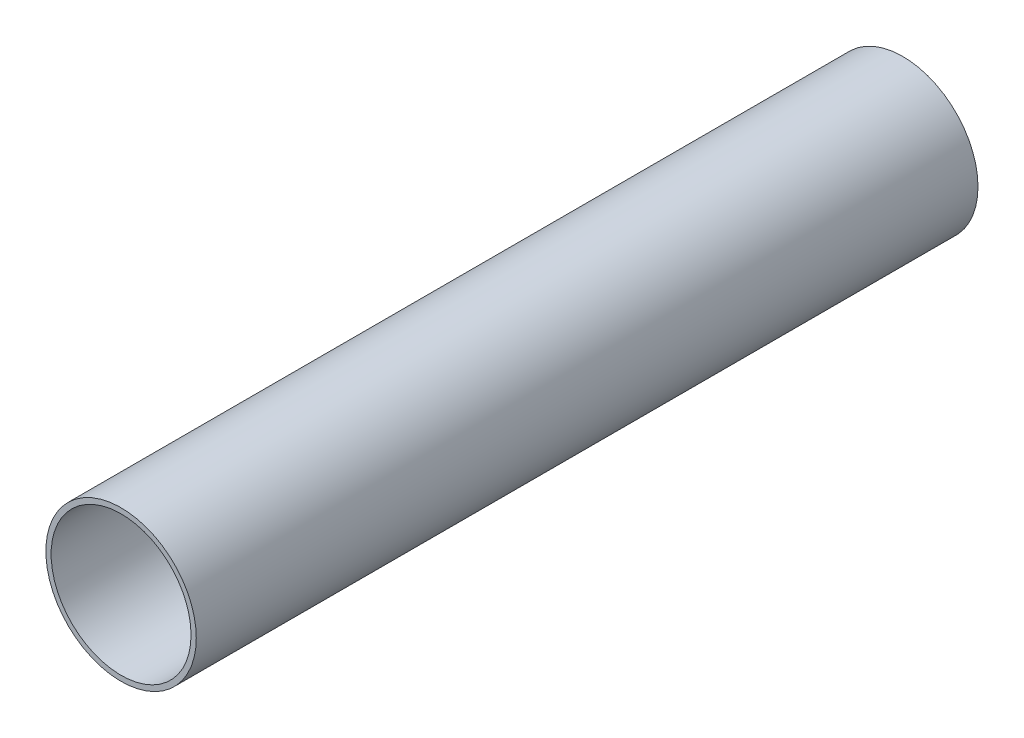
ISO-10303-21;
HEADER;
FILE_DESCRIPTION(('STEP AP214'),'2;1');
FILE_NAME('part.step','',(''),(''),'','','');
FILE_SCHEMA(('AUTOMOTIVE_DESIGN { 1 0 10303 214 1 1 1 1 }'));
ENDSEC;
DATA;
#1=APPLICATION_CONTEXT('core data for automotive mechanical design processes');
#2=APPLICATION_PROTOCOL_DEFINITION('international standard','automotive_design',2000,#1);
#3=PRODUCT_CONTEXT('',#1,'mechanical');
#4=PRODUCT('Part','Part','',(#3));
#5=PRODUCT_RELATED_PRODUCT_CATEGORY('part','',(#4));
#6=PRODUCT_DEFINITION_FORMATION('','',#4);
#7=PRODUCT_DEFINITION_CONTEXT('part definition',#1,'design');
#8=PRODUCT_DEFINITION('design','',#6,#7);
#9=PRODUCT_DEFINITION_SHAPE('','',#8);
#10=(LENGTH_UNIT() NAMED_UNIT(*) SI_UNIT(.MILLI.,.METRE.));
#11=(NAMED_UNIT(*) PLANE_ANGLE_UNIT() SI_UNIT($,.RADIAN.));
#12=(NAMED_UNIT(*) SI_UNIT($,.STERADIAN.) SOLID_ANGLE_UNIT());
#13=UNCERTAINTY_MEASURE_WITH_UNIT(LENGTH_MEASURE(1.E-05),#10,'distance_accuracy_value','');
#14=(GEOMETRIC_REPRESENTATION_CONTEXT(3) GLOBAL_UNCERTAINTY_ASSIGNED_CONTEXT((#13)) GLOBAL_UNIT_ASSIGNED_CONTEXT((#10,
#11,#12)) REPRESENTATION_CONTEXT('',''));
#15=CARTESIAN_POINT('',(0.,0.,0.));
#16=DIRECTION('',(0.,0.,1.));
#17=DIRECTION('',(1.,0.,0.));
#18=AXIS2_PLACEMENT_3D('',#15,#16,#17);
#19=CARTESIAN_POINT('',(0.,0.,302.26));
#20=DIRECTION('',(0.,0.,1.));
#21=DIRECTION('',(1.,0.,0.));
#22=AXIS2_PLACEMENT_3D('',#19,#20,#21);
#23=PLANE('',#22);
#24=CARTESIAN_POINT('',(0.,0.,302.26));
#25=DIRECTION('',(0.,0.,1.));
#26=DIRECTION('',(1.,0.,0.));
#27=AXIS2_PLACEMENT_3D('',#24,#25,#26);
#28=CIRCLE('',#27,29.083);
#29=CARTESIAN_POINT('',(29.083,0.,302.26));
#30=VERTEX_POINT('',#29);
#31=EDGE_CURVE('E10',#30,#30,#28,.T.);
#32=ORIENTED_EDGE('',*,*,#31,.T.);
#33=EDGE_LOOP('',(#32));
#34=FACE_BOUND('',#33,.T.);
#35=CARTESIAN_POINT('',(0.,0.,302.26));
#36=DIRECTION('',(0.,0.,1.));
#37=DIRECTION('',(1.,0.,0.));
#38=AXIS2_PLACEMENT_3D('',#35,#36,#37);
#39=CIRCLE('',#38,27.051);
#40=CARTESIAN_POINT('',(27.051,0.,302.26));
#41=VERTEX_POINT('',#40);
#42=EDGE_CURVE('E39',#41,#41,#39,.T.);
#43=ORIENTED_EDGE('',*,*,#42,.F.);
#44=EDGE_LOOP('',(#43));
#45=FACE_BOUND('',#44,.T.);
#46=ADVANCED_FACE('F28',(#34,#45),#23,.T.);
#47=CARTESIAN_POINT('',(0.,0.,0.));
#48=DIRECTION('',(0.,0.,1.));
#49=DIRECTION('',(1.,0.,0.));
#50=AXIS2_PLACEMENT_3D('',#47,#48,#49);
#51=PLANE('',#50);
#52=CARTESIAN_POINT('',(0.,0.,0.));
#53=DIRECTION('',(0.,0.,1.));
#54=DIRECTION('',(1.,0.,0.));
#55=AXIS2_PLACEMENT_3D('',#52,#53,#54);
#56=CIRCLE('',#55,29.083);
#57=CARTESIAN_POINT('',(29.083,0.,0.));
#58=VERTEX_POINT('',#57);
#59=EDGE_CURVE('E35',#58,#58,#56,.T.);
#60=ORIENTED_EDGE('',*,*,#59,.F.);
#61=EDGE_LOOP('',(#60));
#62=FACE_BOUND('',#61,.T.);
#63=CARTESIAN_POINT('',(0.,0.,0.));
#64=DIRECTION('',(0.,0.,1.));
#65=DIRECTION('',(1.,0.,0.));
#66=AXIS2_PLACEMENT_3D('',#63,#64,#65);
#67=CIRCLE('',#66,27.051);
#68=CARTESIAN_POINT('',(27.051,0.,0.));
#69=VERTEX_POINT('',#68);
#70=EDGE_CURVE('E43',#69,#69,#67,.T.);
#71=ORIENTED_EDGE('',*,*,#70,.T.);
#72=EDGE_LOOP('',(#71));
#73=FACE_BOUND('',#72,.T.);
#74=ADVANCED_FACE('F49',(#62,#73),#51,.F.);
#75=CARTESIAN_POINT('',(0.,0.,302.26));
#76=DIRECTION('',(0.,0.,-1.));
#77=DIRECTION('',(-1.,0.,0.));
#78=AXIS2_PLACEMENT_3D('',#75,#76,#77);
#79=CYLINDRICAL_SURFACE('',#78,29.083);
#80=ORIENTED_EDGE('',*,*,#31,.F.);
#81=EDGE_LOOP('',(#80));
#82=FACE_BOUND('',#81,.T.);
#83=ORIENTED_EDGE('',*,*,#59,.T.);
#84=EDGE_LOOP('',(#83));
#85=FACE_BOUND('',#84,.T.);
#86=ADVANCED_FACE('F30',(#82,#85),#79,.T.);
#87=CARTESIAN_POINT('',(0.,0.,302.26));
#88=DIRECTION('',(0.,0.,-1.));
#89=DIRECTION('',(-1.,0.,0.));
#90=AXIS2_PLACEMENT_3D('',#87,#88,#89);
#91=CYLINDRICAL_SURFACE('',#90,27.051);
#92=ORIENTED_EDGE('',*,*,#42,.T.);
#93=EDGE_LOOP('',(#92));
#94=FACE_BOUND('',#93,.T.);
#95=ORIENTED_EDGE('',*,*,#70,.F.);
#96=EDGE_LOOP('',(#95));
#97=FACE_BOUND('',#96,.T.);
#98=ADVANCED_FACE('F51',(#94,#97),#91,.F.);
#99=CLOSED_SHELL('',(#46,#74,#86,#98));
#100=MANIFOLD_SOLID_BREP('B2',#99);
#101=ADVANCED_BREP_SHAPE_REPRESENTATION('',(#18,#100),#14);
#102=SHAPE_DEFINITION_REPRESENTATION(#9,#101);
ENDSEC;
END-ISO-10303-21;
